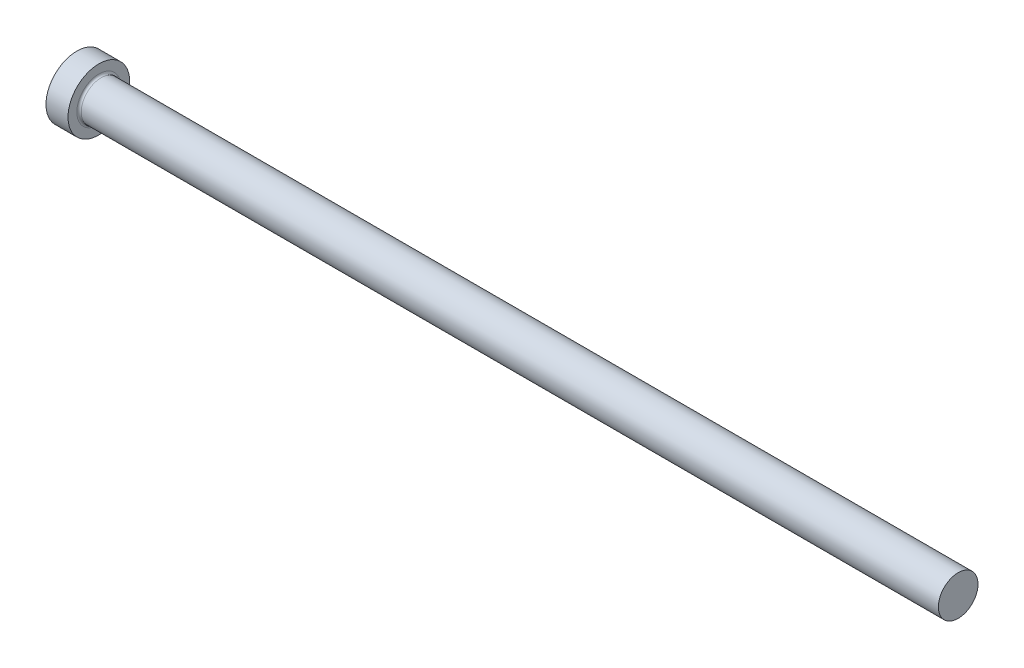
ISO-10303-21;
HEADER;
FILE_DESCRIPTION(('STEP AP214'),'2;1');
FILE_NAME('part.step','',(''),(''),'','','');
FILE_SCHEMA(('AUTOMOTIVE_DESIGN { 1 0 10303 214 1 1 1 1 }'));
ENDSEC;
DATA;
#1=APPLICATION_CONTEXT('core data for automotive mechanical design processes');
#2=APPLICATION_PROTOCOL_DEFINITION('international standard','automotive_design',2000,#1);
#3=PRODUCT_CONTEXT('',#1,'mechanical');
#4=PRODUCT('Part','Part','',(#3));
#5=PRODUCT_RELATED_PRODUCT_CATEGORY('part','',(#4));
#6=PRODUCT_DEFINITION_FORMATION('','',#4);
#7=PRODUCT_DEFINITION_CONTEXT('part definition',#1,'design');
#8=PRODUCT_DEFINITION('design','',#6,#7);
#9=PRODUCT_DEFINITION_SHAPE('','',#8);
#10=(LENGTH_UNIT() NAMED_UNIT(*) SI_UNIT(.MILLI.,.METRE.));
#11=(NAMED_UNIT(*) PLANE_ANGLE_UNIT() SI_UNIT($,.RADIAN.));
#12=(NAMED_UNIT(*) SI_UNIT($,.STERADIAN.) SOLID_ANGLE_UNIT());
#13=UNCERTAINTY_MEASURE_WITH_UNIT(LENGTH_MEASURE(1.E-05),#10,'distance_accuracy_value','');
#14=(GEOMETRIC_REPRESENTATION_CONTEXT(3) GLOBAL_UNCERTAINTY_ASSIGNED_CONTEXT((#13)) GLOBAL_UNIT_ASSIGNED_CONTEXT((#10,
#11,#12)) REPRESENTATION_CONTEXT('',''));
#15=CARTESIAN_POINT('',(0.,0.,0.));
#16=DIRECTION('',(0.,0.,1.));
#17=DIRECTION('',(1.,0.,0.));
#18=AXIS2_PLACEMENT_3D('',#15,#16,#17);
#19=CARTESIAN_POINT('',(0.,0.,0.));
#20=DIRECTION('',(-1.,0.,0.));
#21=DIRECTION('',(0.,-1.,0.));
#22=AXIS2_PLACEMENT_3D('',#19,#20,#21);
#23=PLANE('',#22);
#24=CARTESIAN_POINT('',(0.,0.,0.));
#25=DIRECTION('',(1.,0.,0.));
#26=DIRECTION('',(0.,1.,0.));
#27=AXIS2_PLACEMENT_3D('',#24,#25,#26);
#28=CIRCLE('',#27,7.);
#29=CARTESIAN_POINT('',(0.,7.,0.));
#30=VERTEX_POINT('',#29);
#31=EDGE_CURVE('E25',#30,#30,#28,.T.);
#32=ORIENTED_EDGE('',*,*,#31,.F.);
#33=EDGE_LOOP('',(#32));
#34=FACE_BOUND('',#33,.T.);
#35=ADVANCED_FACE('F14',(#34),#23,.T.);
#36=CARTESIAN_POINT('',(200.,0.,0.));
#37=DIRECTION('',(1.,0.,0.));
#38=DIRECTION('',(0.,1.,0.));
#39=AXIS2_PLACEMENT_3D('',#36,#37,#38);
#40=CYLINDRICAL_SURFACE('',#39,7.);
#41=ORIENTED_EDGE('',*,*,#31,.T.);
#42=EDGE_LOOP('',(#41));
#43=FACE_BOUND('',#42,.T.);
#44=CARTESIAN_POINT('',(5.,0.,0.));
#45=DIRECTION('',(1.,0.,0.));
#46=DIRECTION('',(0.,1.,0.));
#47=AXIS2_PLACEMENT_3D('',#44,#45,#46);
#48=CIRCLE('',#47,7.);
#49=CARTESIAN_POINT('',(5.,7.,0.));
#50=VERTEX_POINT('',#49);
#51=EDGE_CURVE('E29',#50,#50,#48,.T.);
#52=ORIENTED_EDGE('',*,*,#51,.F.);
#53=EDGE_LOOP('',(#52));
#54=FACE_BOUND('',#53,.T.);
#55=ADVANCED_FACE('F51',(#43,#54),#40,.T.);
#56=CARTESIAN_POINT('',(5.,7.,0.));
#57=DIRECTION('',(1.,0.,0.));
#58=DIRECTION('',(0.,1.,0.));
#59=AXIS2_PLACEMENT_3D('',#56,#57,#58);
#60=PLANE('',#59);
#61=CARTESIAN_POINT('',(5.,0.,0.));
#62=DIRECTION('',(1.,0.,0.));
#63=DIRECTION('',(0.,1.,0.));
#64=AXIS2_PLACEMENT_3D('',#61,#62,#63);
#65=CIRCLE('',#64,4.99999999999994);
#66=CARTESIAN_POINT('',(5.,4.99999999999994,0.));
#67=VERTEX_POINT('',#66);
#68=EDGE_CURVE('E9',#67,#67,#65,.F.);
#69=ORIENTED_EDGE('',*,*,#68,.T.);
#70=EDGE_LOOP('',(#69));
#71=FACE_BOUND('',#70,.T.);
#72=ORIENTED_EDGE('',*,*,#51,.T.);
#73=EDGE_LOOP('',(#72));
#74=FACE_BOUND('',#73,.T.);
#75=ADVANCED_FACE('F42',(#71,#74),#60,.T.);
#76=CARTESIAN_POINT('',(200.,0.,0.));
#77=DIRECTION('',(1.,0.,0.));
#78=DIRECTION('',(0.,1.,0.));
#79=AXIS2_PLACEMENT_3D('',#76,#77,#78);
#80=CYLINDRICAL_SURFACE('',#79,4.49999999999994);
#81=CARTESIAN_POINT('',(5.5,0.,0.));
#82=DIRECTION('',(1.,0.,0.));
#83=DIRECTION('',(0.,1.,0.));
#84=AXIS2_PLACEMENT_3D('',#81,#82,#83);
#85=CIRCLE('',#84,4.49999999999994);
#86=CARTESIAN_POINT('',(5.5,4.49999999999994,0.));
#87=VERTEX_POINT('',#86);
#88=EDGE_CURVE('E21',#87,#87,#85,.T.);
#89=ORIENTED_EDGE('',*,*,#88,.T.);
#90=EDGE_LOOP('',(#89));
#91=FACE_BOUND('',#90,.T.);
#92=CARTESIAN_POINT('',(200.,0.,0.));
#93=DIRECTION('',(1.,0.,0.));
#94=DIRECTION('',(0.,1.,0.));
#95=AXIS2_PLACEMENT_3D('',#92,#93,#94);
#96=CIRCLE('',#95,4.5);
#97=CARTESIAN_POINT('',(200.,4.5,0.));
#98=VERTEX_POINT('',#97);
#99=EDGE_CURVE('E34',#98,#98,#96,.T.);
#100=ORIENTED_EDGE('',*,*,#99,.F.);
#101=EDGE_LOOP('',(#100));
#102=FACE_BOUND('',#101,.T.);
#103=ADVANCED_FACE('F40',(#91,#102),#80,.T.);
#104=CARTESIAN_POINT('',(200.,4.5,0.));
#105=DIRECTION('',(1.,0.,0.));
#106=DIRECTION('',(0.,1.,0.));
#107=AXIS2_PLACEMENT_3D('',#104,#105,#106);
#108=PLANE('',#107);
#109=ORIENTED_EDGE('',*,*,#99,.T.);
#110=EDGE_LOOP('',(#109));
#111=FACE_BOUND('',#110,.T.);
#112=ADVANCED_FACE('F38',(#111),#108,.T.);
#113=CARTESIAN_POINT('',(5.5,0.,0.));
#114=DIRECTION('',(1.,0.,0.));
#115=DIRECTION('',(0.,1.,0.));
#116=AXIS2_PLACEMENT_3D('',#113,#114,#115);
#117=TOROIDAL_SURFACE('',#116,4.99999999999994,0.5);
#118=ORIENTED_EDGE('',*,*,#68,.F.);
#119=EDGE_LOOP('',(#118));
#120=FACE_BOUND('',#119,.T.);
#121=ORIENTED_EDGE('',*,*,#88,.F.);
#122=EDGE_LOOP('',(#121));
#123=FACE_BOUND('',#122,.T.);
#124=ADVANCED_FACE('F16',(#120,#123),#117,.F.);
#125=CLOSED_SHELL('',(#35,#55,#75,#103,#112,#124));
#126=MANIFOLD_SOLID_BREP('B1',#125);
#127=ADVANCED_BREP_SHAPE_REPRESENTATION('',(#18,#126),#14);
#128=SHAPE_DEFINITION_REPRESENTATION(#9,#127);
ENDSEC;
END-ISO-10303-21;
